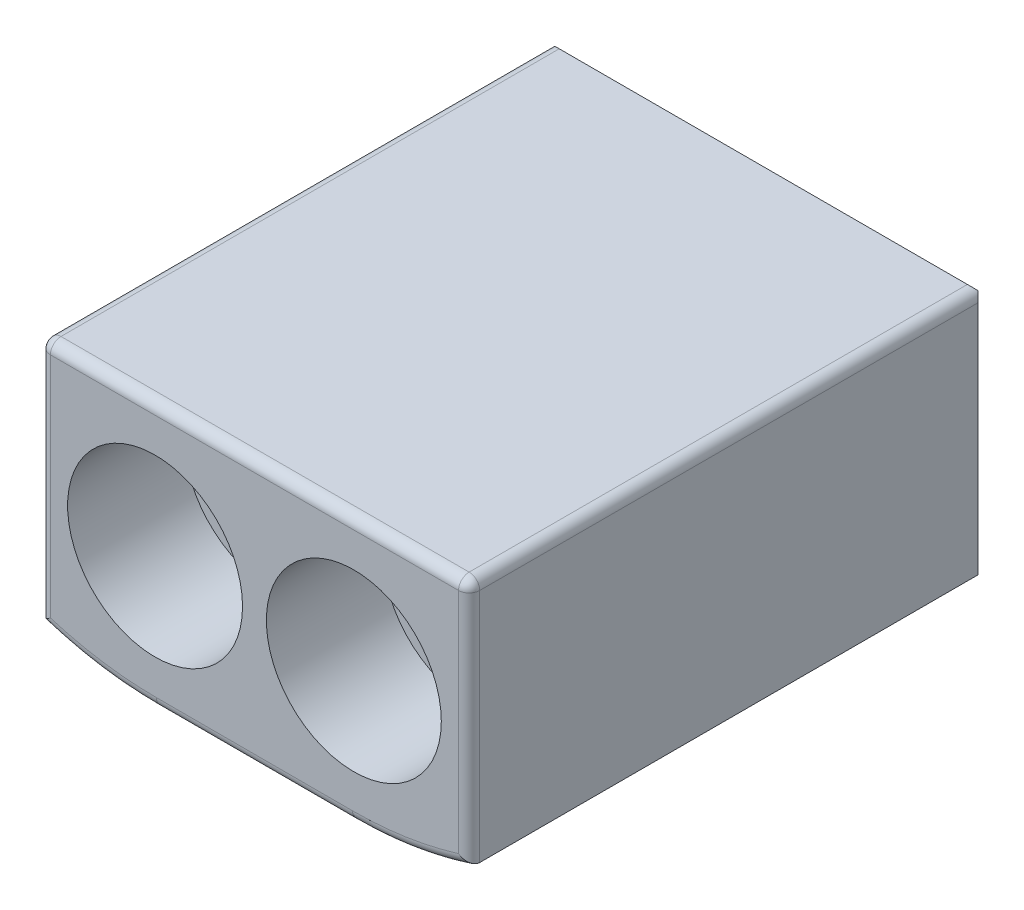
from build123d import *

# Parameters (mm, degrees)
BOSS_EXTRUDE1_DEPTH = 25.4
SKETCH3_R           = 2.794
CUT_EXTRUDE1_DEPTH  = 31.203846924
SKETCH4_R           = 4.191
CUT_EXTRUDE2_DEPTH  = 5.588
CHAMFER3_SIZE       = 1.016
FILLET3_R           = 0.508


with BuildPart() as part:
    # Sketch1 → Boss-Extrude1 (new body)
    with BuildSketch(Plane.XY):
        with BuildLine():
            Line((-4.699, -12.7), (4.699, -12.7))
            ThreePointArc((4.699, -12.7), (7.529081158, -12.473319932), (10.287, -11.799059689))
            Line((10.287, -11.799059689), (10.287, 0))
            Line((10.287, 0), (-10.287, 0))
            Line((-10.287, 0), (-10.287, -11.799059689))
            ThreePointArc((-10.287, -11.799059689), (-7.529081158, -12.473319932), (-4.699, -12.7))
        make_face()
    extrude(amount=-BOSS_EXTRUDE1_DEPTH)

    # Sketch3 → Cut-Extrude1 (cut, through all)
    with BuildSketch(Plane.XY):
        with Locations((4.7625, -6.35)):
            Circle(SKETCH3_R)
        with Locations((-4.7625, -6.35)):
            Circle(SKETCH3_R)
    extrude(amount=-CUT_EXTRUDE1_DEPTH, mode=Mode.SUBTRACT)

    # Sketch4 → Cut-Extrude2 (cut)
    with BuildSketch(Plane.XY):
        with Locations((4.7625, -6.35)):
            Circle(SKETCH4_R)
        with Locations((-4.7625, -6.35)):
            Circle(SKETCH4_R)
    extrude(amount=-CUT_EXTRUDE2_DEPTH, mode=Mode.SUBTRACT)

    # Chamfer3
    chamfer3_edges = [part.edges().sort_by_distance(p)[0] for p in [
        (7.529081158, -12.473319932, -25.4),
        (10.287, -5.899529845, -25.4),
        (0, 0, -25.4),
        (-10.287, -5.899529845, -25.4),
        (-7.529081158, -12.473319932, -25.4),
        (0, -12.7, -25.4),
    ]]
    chamfer(chamfer3_edges, length=CHAMFER3_SIZE)

    # Fillet3
    fillet3_edges = [part.edges().sort_by_distance(p)[0] for p in [
        (10.287, 0, -12.192),
        (-10.287, 0, -12.192),
        (-10.287, -5.899529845, 0),
        (0, 0, 0),
        (10.287, -5.899529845, 0),
        (7.529081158, -12.473319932, 0),
        (0, -12.7, 0),
        (-7.529081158, -12.473319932, 0),
    ]]
    fillet(fillet3_edges, radius=FILLET3_R)


solid = part.part
